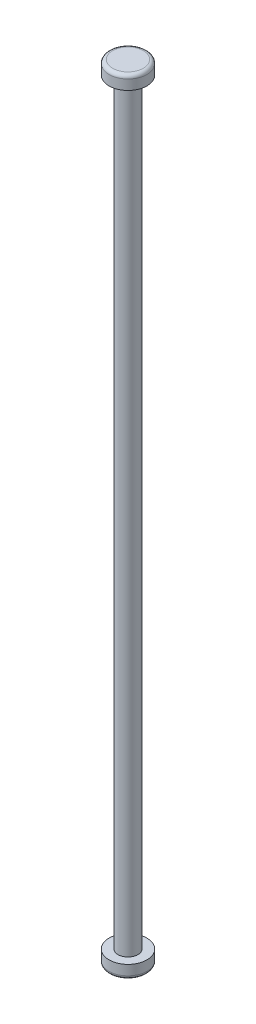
ISO-10303-21;
HEADER;
FILE_DESCRIPTION(('STEP AP214'),'2;1');
FILE_NAME('part.step','',(''),(''),'','','');
FILE_SCHEMA(('AUTOMOTIVE_DESIGN { 1 0 10303 214 1 1 1 1 }'));
ENDSEC;
DATA;
#1=APPLICATION_CONTEXT('core data for automotive mechanical design processes');
#2=APPLICATION_PROTOCOL_DEFINITION('international standard','automotive_design',2000,#1);
#3=PRODUCT_CONTEXT('',#1,'mechanical');
#4=PRODUCT('Part','Part','',(#3));
#5=PRODUCT_RELATED_PRODUCT_CATEGORY('part','',(#4));
#6=PRODUCT_DEFINITION_FORMATION('','',#4);
#7=PRODUCT_DEFINITION_CONTEXT('part definition',#1,'design');
#8=PRODUCT_DEFINITION('design','',#6,#7);
#9=PRODUCT_DEFINITION_SHAPE('','',#8);
#10=(LENGTH_UNIT() NAMED_UNIT(*) SI_UNIT(.MILLI.,.METRE.));
#11=(NAMED_UNIT(*) PLANE_ANGLE_UNIT() SI_UNIT($,.RADIAN.));
#12=(NAMED_UNIT(*) SI_UNIT($,.STERADIAN.) SOLID_ANGLE_UNIT());
#13=UNCERTAINTY_MEASURE_WITH_UNIT(LENGTH_MEASURE(1.E-05),#10,'distance_accuracy_value','');
#14=(GEOMETRIC_REPRESENTATION_CONTEXT(3) GLOBAL_UNCERTAINTY_ASSIGNED_CONTEXT((#13)) GLOBAL_UNIT_ASSIGNED_CONTEXT((#10,
#11,#12)) REPRESENTATION_CONTEXT('',''));
#15=CARTESIAN_POINT('',(0.,0.,0.));
#16=DIRECTION('',(0.,0.,1.));
#17=DIRECTION('',(1.,0.,0.));
#18=AXIS2_PLACEMENT_3D('',#15,#16,#17);
#19=CARTESIAN_POINT('',(0.,14.7,0.));
#20=DIRECTION('',(0.,-1.,0.));
#21=DIRECTION('',(0.,0.,-1.));
#22=AXIS2_PLACEMENT_3D('',#19,#20,#21);
#23=CYLINDRICAL_SURFACE('',#22,0.385);
#24=CARTESIAN_POINT('',(0.,14.7,0.));
#25=DIRECTION('',(0.,1.,0.));
#26=DIRECTION('',(0.,0.,1.));
#27=AXIS2_PLACEMENT_3D('',#24,#25,#26);
#28=CIRCLE('',#27,0.385);
#29=CARTESIAN_POINT('',(0.,14.7,0.385));
#30=VERTEX_POINT('',#29);
#31=EDGE_CURVE('E65',#30,#30,#28,.T.);
#32=ORIENTED_EDGE('',*,*,#31,.F.);
#33=EDGE_LOOP('',(#32));
#34=FACE_BOUND('',#33,.T.);
#35=CARTESIAN_POINT('',(0.,-14.7,0.));
#36=DIRECTION('',(0.,1.,0.));
#37=DIRECTION('',(0.,0.,1.));
#38=AXIS2_PLACEMENT_3D('',#35,#36,#37);
#39=CIRCLE('',#38,0.385);
#40=CARTESIAN_POINT('',(0.,-14.7,0.385));
#41=VERTEX_POINT('',#40);
#42=EDGE_CURVE('E66',#41,#41,#39,.T.);
#43=ORIENTED_EDGE('',*,*,#42,.T.);
#44=EDGE_LOOP('',(#43));
#45=FACE_BOUND('',#44,.T.);
#46=ADVANCED_FACE('F45',(#34,#45),#23,.T.);
#47=CARTESIAN_POINT('',(0.,15.225,0.));
#48=DIRECTION('',(0.,-1.,0.));
#49=DIRECTION('',(0.,0.,-1.));
#50=AXIS2_PLACEMENT_3D('',#47,#48,#49);
#51=CYLINDRICAL_SURFACE('',#50,0.735);
#52=CARTESIAN_POINT('',(0.,15.085,0.));
#53=DIRECTION('',(0.,1.,0.));
#54=DIRECTION('',(0.,0.,1.));
#55=AXIS2_PLACEMENT_3D('',#52,#53,#54);
#56=CIRCLE('',#55,0.735);
#57=CARTESIAN_POINT('',(0.,15.085,0.735));
#58=VERTEX_POINT('',#57);
#59=EDGE_CURVE('E56',#58,#58,#56,.F.);
#60=ORIENTED_EDGE('',*,*,#59,.T.);
#61=EDGE_LOOP('',(#60));
#62=FACE_BOUND('',#61,.T.);
#63=CARTESIAN_POINT('',(0.,14.7,0.));
#64=DIRECTION('',(0.,1.,0.));
#65=DIRECTION('',(0.,0.,1.));
#66=AXIS2_PLACEMENT_3D('',#63,#64,#65);
#67=CIRCLE('',#66,0.735);
#68=CARTESIAN_POINT('',(0.,14.7,0.735));
#69=VERTEX_POINT('',#68);
#70=EDGE_CURVE('E69',#69,#69,#67,.T.);
#71=ORIENTED_EDGE('',*,*,#70,.T.);
#72=EDGE_LOOP('',(#71));
#73=FACE_BOUND('',#72,.T.);
#74=ADVANCED_FACE('F96',(#62,#73),#51,.T.);
#75=CARTESIAN_POINT('',(0.,15.225,0.));
#76=DIRECTION('',(0.,1.,0.));
#77=DIRECTION('',(0.,0.,1.));
#78=AXIS2_PLACEMENT_3D('',#75,#76,#77);
#79=PLANE('',#78);
#80=CARTESIAN_POINT('',(0.,15.225,0.));
#81=DIRECTION('',(0.,1.,0.));
#82=DIRECTION('',(0.,0.,1.));
#83=AXIS2_PLACEMENT_3D('',#80,#81,#82);
#84=CIRCLE('',#83,0.595);
#85=CARTESIAN_POINT('',(0.,15.225,0.595));
#86=VERTEX_POINT('',#85);
#87=EDGE_CURVE('E60',#86,#86,#84,.T.);
#88=ORIENTED_EDGE('',*,*,#87,.T.);
#89=EDGE_LOOP('',(#88));
#90=FACE_BOUND('',#89,.T.);
#91=ADVANCED_FACE('F90',(#90),#79,.T.);
#92=CARTESIAN_POINT('',(0.,14.7,0.));
#93=DIRECTION('',(0.,1.,0.));
#94=DIRECTION('',(0.,0.,1.));
#95=AXIS2_PLACEMENT_3D('',#92,#93,#94);
#96=PLANE('',#95);
#97=ORIENTED_EDGE('',*,*,#31,.T.);
#98=EDGE_LOOP('',(#97));
#99=FACE_BOUND('',#98,.T.);
#100=ORIENTED_EDGE('',*,*,#70,.F.);
#101=EDGE_LOOP('',(#100));
#102=FACE_BOUND('',#101,.T.);
#103=ADVANCED_FACE('F83',(#99,#102),#96,.F.);
#104=CARTESIAN_POINT('',(0.,-15.225,0.));
#105=DIRECTION('',(0.,1.,0.));
#106=DIRECTION('',(0.,0.,1.));
#107=AXIS2_PLACEMENT_3D('',#104,#105,#106);
#108=CYLINDRICAL_SURFACE('',#107,0.735);
#109=CARTESIAN_POINT('',(0.,-15.085,0.));
#110=DIRECTION('',(0.,-1.,0.));
#111=DIRECTION('',(0.,0.,-1.));
#112=AXIS2_PLACEMENT_3D('',#109,#110,#111);
#113=CIRCLE('',#112,0.735);
#114=CARTESIAN_POINT('',(0.,-15.085,-0.735));
#115=VERTEX_POINT('',#114);
#116=EDGE_CURVE('E52',#115,#115,#113,.F.);
#117=ORIENTED_EDGE('',*,*,#116,.T.);
#118=EDGE_LOOP('',(#117));
#119=FACE_BOUND('',#118,.T.);
#120=CARTESIAN_POINT('',(0.,-14.7,0.));
#121=DIRECTION('',(0.,1.,0.));
#122=DIRECTION('',(0.,0.,1.));
#123=AXIS2_PLACEMENT_3D('',#120,#121,#122);
#124=CIRCLE('',#123,0.735);
#125=CARTESIAN_POINT('',(0.,-14.7,0.735));
#126=VERTEX_POINT('',#125);
#127=EDGE_CURVE('E70',#126,#126,#124,.T.);
#128=ORIENTED_EDGE('',*,*,#127,.F.);
#129=EDGE_LOOP('',(#128));
#130=FACE_BOUND('',#129,.T.);
#131=ADVANCED_FACE('F80',(#119,#130),#108,.T.);
#132=CARTESIAN_POINT('',(0.,-15.225,0.));
#133=DIRECTION('',(0.,-1.,0.));
#134=DIRECTION('',(0.,0.,1.));
#135=AXIS2_PLACEMENT_3D('',#132,#133,#134);
#136=PLANE('',#135);
#137=CARTESIAN_POINT('',(0.,-15.225,0.));
#138=DIRECTION('',(0.,-1.,0.));
#139=DIRECTION('',(0.,0.,-1.));
#140=AXIS2_PLACEMENT_3D('',#137,#138,#139);
#141=CIRCLE('',#140,0.595);
#142=CARTESIAN_POINT('',(0.,-15.225,-0.595));
#143=VERTEX_POINT('',#142);
#144=EDGE_CURVE('E10',#143,#143,#141,.T.);
#145=ORIENTED_EDGE('',*,*,#144,.T.);
#146=EDGE_LOOP('',(#145));
#147=FACE_BOUND('',#146,.T.);
#148=ADVANCED_FACE('F82',(#147),#136,.T.);
#149=CARTESIAN_POINT('',(0.,-14.7,0.));
#150=DIRECTION('',(0.,-1.,0.));
#151=DIRECTION('',(0.,0.,1.));
#152=AXIS2_PLACEMENT_3D('',#149,#150,#151);
#153=PLANE('',#152);
#154=ORIENTED_EDGE('',*,*,#42,.F.);
#155=EDGE_LOOP('',(#154));
#156=FACE_BOUND('',#155,.T.);
#157=ORIENTED_EDGE('',*,*,#127,.T.);
#158=EDGE_LOOP('',(#157));
#159=FACE_BOUND('',#158,.T.);
#160=ADVANCED_FACE('F78',(#156,#159),#153,.F.);
#161=CARTESIAN_POINT('',(0.,15.085,0.));
#162=DIRECTION('',(0.,1.,0.));
#163=DIRECTION('',(0.,0.,1.));
#164=AXIS2_PLACEMENT_3D('',#161,#162,#163);
#165=TOROIDAL_SURFACE('',#164,0.595,0.14);
#166=ORIENTED_EDGE('',*,*,#59,.F.);
#167=EDGE_LOOP('',(#166));
#168=FACE_BOUND('',#167,.T.);
#169=ORIENTED_EDGE('',*,*,#87,.F.);
#170=EDGE_LOOP('',(#169));
#171=FACE_BOUND('',#170,.T.);
#172=ADVANCED_FACE('F106',(#168,#171),#165,.T.);
#173=CARTESIAN_POINT('',(0.,-15.085,0.));
#174=DIRECTION('',(0.,-1.,0.));
#175=DIRECTION('',(0.,0.,-1.));
#176=AXIS2_PLACEMENT_3D('',#173,#174,#175);
#177=TOROIDAL_SURFACE('',#176,0.595,0.14);
#178=ORIENTED_EDGE('',*,*,#144,.F.);
#179=EDGE_LOOP('',(#178));
#180=FACE_BOUND('',#179,.T.);
#181=ORIENTED_EDGE('',*,*,#116,.F.);
#182=EDGE_LOOP('',(#181));
#183=FACE_BOUND('',#182,.T.);
#184=ADVANCED_FACE('F47',(#180,#183),#177,.T.);
#185=CLOSED_SHELL('',(#46,#74,#91,#103,#131,#148,#160,#172,#184));
#186=MANIFOLD_SOLID_BREP('B2',#185);
#187=ADVANCED_BREP_SHAPE_REPRESENTATION('',(#18,#186),#14);
#188=SHAPE_DEFINITION_REPRESENTATION(#9,#187);
ENDSEC;
END-ISO-10303-21;
